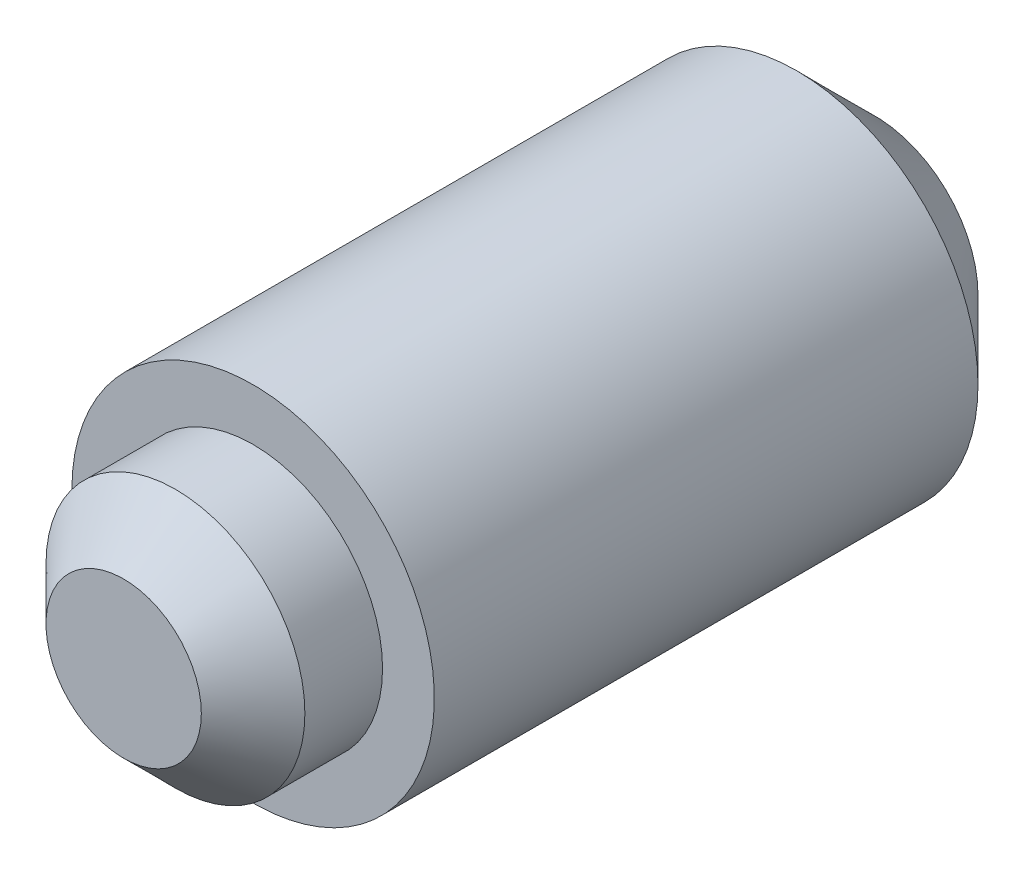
from build123d import *

# Parameters (mm, degrees)
SKICA1_R                 = 7
VYSUNOUT1_DEPTH          = 14.5
SKICA2_OUTSIDE_W         = 23.022
SKICA2_OUTSIDE_H         = 23.022
SKICA2_OUTSIDE_R         = 5
ODEBRAT_VYSUNUT_M1_DEPTH = 5
ZKOSIT1_SIZE             = 3
ZKOSIT2_SIZE             = 2


with BuildPart() as part:
    # Skica1 → Vysunout1 (new, symmetric)
    with BuildSketch(Plane.XY):
        with Locations(Location((0, 0, 0), (0, 0, 180))):
            Circle(SKICA1_R)
    extrude(amount=VYSUNOUT1_DEPTH, both=True)

    # Skica2 outside → Odebrat vysunut_m1 (cut)
    with BuildSketch(Plane.XY.offset(14.5)):
        Rectangle(SKICA2_OUTSIDE_W, SKICA2_OUTSIDE_H)
        Circle(SKICA2_OUTSIDE_R, mode=Mode.SUBTRACT)
    extrude(amount=-ODEBRAT_VYSUNUT_M1_DEPTH, mode=Mode.SUBTRACT)

    # Zkosit1
    zkosit1_edges = [part.edges().sort_by_distance(p)[0] for p in [
        (7, 0, -14.5),
    ]]
    chamfer(zkosit1_edges, length=ZKOSIT1_SIZE)

    # Zkosit2
    zkosit2_edges = [part.edges().sort_by_distance(p)[0] for p in [
        (-5, 0, 14.5),
    ]]
    chamfer(zkosit2_edges, length=ZKOSIT2_SIZE)


solid = part.part
